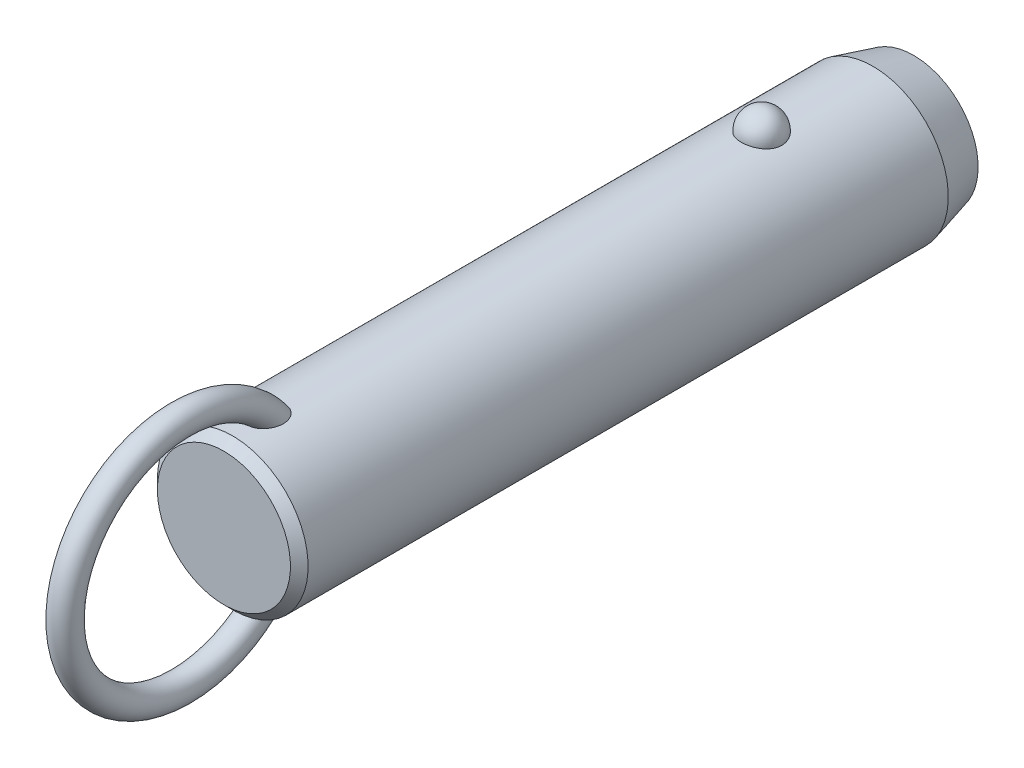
ISO-10303-21;
HEADER;
FILE_DESCRIPTION(('STEP AP214'),'2;1');
FILE_NAME('part.step','',(''),(''),'','','');
FILE_SCHEMA(('AUTOMOTIVE_DESIGN { 1 0 10303 214 1 1 1 1 }'));
ENDSEC;
DATA;
#1=APPLICATION_CONTEXT('core data for automotive mechanical design processes');
#2=APPLICATION_PROTOCOL_DEFINITION('international standard','automotive_design',2000,#1);
#3=PRODUCT_CONTEXT('',#1,'mechanical');
#4=PRODUCT('Part','Part','',(#3));
#5=PRODUCT_RELATED_PRODUCT_CATEGORY('part','',(#4));
#6=PRODUCT_DEFINITION_FORMATION('','',#4);
#7=PRODUCT_DEFINITION_CONTEXT('part definition',#1,'design');
#8=PRODUCT_DEFINITION('design','',#6,#7);
#9=PRODUCT_DEFINITION_SHAPE('','',#8);
#10=(LENGTH_UNIT() NAMED_UNIT(*) SI_UNIT(.MILLI.,.METRE.));
#11=(NAMED_UNIT(*) PLANE_ANGLE_UNIT() SI_UNIT($,.RADIAN.));
#12=(NAMED_UNIT(*) SI_UNIT($,.STERADIAN.) SOLID_ANGLE_UNIT());
#13=UNCERTAINTY_MEASURE_WITH_UNIT(LENGTH_MEASURE(1.E-05),#10,'distance_accuracy_value','');
#14=(GEOMETRIC_REPRESENTATION_CONTEXT(3) GLOBAL_UNCERTAINTY_ASSIGNED_CONTEXT((#13)) GLOBAL_UNIT_ASSIGNED_CONTEXT((#10,
#11,#12)) REPRESENTATION_CONTEXT('',''));
#15=CARTESIAN_POINT('',(0.,0.,0.));
#16=DIRECTION('',(0.,0.,1.));
#17=DIRECTION('',(1.,0.,0.));
#18=AXIS2_PLACEMENT_3D('',#15,#16,#17);
#19=CARTESIAN_POINT('',(0.,0.,63.5));
#20=DIRECTION('',(0.,0.,-1.));
#21=DIRECTION('',(-1.,0.,0.));
#22=AXIS2_PLACEMENT_3D('',#19,#20,#21);
#23=CYLINDRICAL_SURFACE('',#22,11.1);
#24=CARTESIAN_POINT('',(2.9724815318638,10.6945945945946,-3.));
#25=CARTESIAN_POINT('',(2.97247830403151,10.6945972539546,-2.83225059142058));
#26=CARTESIAN_POINT('',(2.95876598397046,10.6984356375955,-2.66445972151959));
#27=CARTESIAN_POINT('',(2.90424529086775,10.7133624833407,-2.33362381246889));
#28=CARTESIAN_POINT('',(2.8634252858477,10.7244540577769,-2.1705808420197));
#29=CARTESIAN_POINT('',(2.75573657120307,10.7526272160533,-1.85396767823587));
#30=CARTESIAN_POINT('',(2.68887937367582,10.7697061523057,-1.70039333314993));
#31=CARTESIAN_POINT('',(2.53079696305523,10.8079438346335,-1.40691598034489));
#32=CARTESIAN_POINT('',(2.43957264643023,10.8291024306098,-1.2670124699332));
#33=CARTESIAN_POINT('',(2.23458150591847,10.8732541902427,-1.00409565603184));
#34=CARTESIAN_POINT('',(2.12071295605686,10.8962553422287,-0.881162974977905));
#35=CARTESIAN_POINT('',(1.87365402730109,10.9414421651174,-0.656352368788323));
#36=CARTESIAN_POINT('',(1.74046358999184,10.9636278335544,-0.554474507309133));
#37=CARTESIAN_POINT('',(1.45872188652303,11.0046495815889,-0.374872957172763));
#38=CARTESIAN_POINT('',(1.31021276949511,11.0234944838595,-0.297085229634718));
#39=CARTESIAN_POINT('',(1.00170030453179,11.0557957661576,-0.167529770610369));
#40=CARTESIAN_POINT('',(0.841698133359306,11.0692526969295,-0.115759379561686));
#41=CARTESIAN_POINT('',(0.517607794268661,11.0890932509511,-0.0403925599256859));
#42=CARTESIAN_POINT('',(0.353633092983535,11.0955916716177,-0.0163383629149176));
#43=CARTESIAN_POINT('',(0.0238420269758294,11.1011989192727,0.0044517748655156));
#44=CARTESIAN_POINT('',(-0.141974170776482,11.1003084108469,0.00119017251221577));
#45=CARTESIAN_POINT('',(-0.468405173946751,11.0912990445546,-0.0323233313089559));
#46=CARTESIAN_POINT('',(-0.629059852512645,11.0832767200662,-0.0622147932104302));
#47=CARTESIAN_POINT('',(-0.942937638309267,11.0609962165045,-0.147645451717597));
#48=CARTESIAN_POINT('',(-1.09616062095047,11.0467379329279,-0.203185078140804));
#49=CARTESIAN_POINT('',(-1.39181061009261,11.0134071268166,-0.3387529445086));
#50=CARTESIAN_POINT('',(-1.53417383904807,10.9943086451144,-0.418913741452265));
#51=CARTESIAN_POINT('',(-1.80342160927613,10.9533667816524,-0.60144882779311));
#52=CARTESIAN_POINT('',(-1.9303046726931,10.9315231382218,-0.703825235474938));
#53=CARTESIAN_POINT('',(-2.16747598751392,10.887005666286,-0.930091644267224));
#54=CARTESIAN_POINT('',(-2.27742774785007,10.8643239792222,-1.05433291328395));
#55=CARTESIAN_POINT('',(-2.47517316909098,10.8209886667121,-1.31966633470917));
#56=CARTESIAN_POINT('',(-2.56296538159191,10.8003351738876,-1.46075958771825));
#57=CARTESIAN_POINT('',(-2.71500300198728,10.7631304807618,-1.75753646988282));
#58=CARTESIAN_POINT('',(-2.77898901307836,10.7466250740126,-1.91335887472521));
#59=CARTESIAN_POINT('',(-2.88046189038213,10.7198747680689,-2.2339152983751));
#60=CARTESIAN_POINT('',(-2.91794947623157,10.709629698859,-2.39864907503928));
#61=CARTESIAN_POINT('',(-2.96537819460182,10.6965949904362,-2.73165170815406));
#62=CARTESIAN_POINT('',(-2.97542891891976,10.693775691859,-2.89990378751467));
#63=CARTESIAN_POINT('',(-2.96804271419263,10.6958279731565,-3.235752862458));
#64=CARTESIAN_POINT('',(-2.95060646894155,10.7006993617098,-3.40334987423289));
#65=CARTESIAN_POINT('',(-2.88883358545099,10.71753912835,-3.73233906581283));
#66=CARTESIAN_POINT('',(-2.84462026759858,10.7294749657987,-3.89375610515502));
#67=CARTESIAN_POINT('',(-2.73050447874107,10.7590797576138,-4.20667949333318));
#68=CARTESIAN_POINT('',(-2.66060103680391,10.7767489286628,-4.35818546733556));
#69=CARTESIAN_POINT('',(-2.49642559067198,10.8159599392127,-4.6478542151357));
#70=CARTESIAN_POINT('',(-2.40203047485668,10.8375211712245,-4.78594458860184));
#71=CARTESIAN_POINT('',(-2.19143488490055,10.8820570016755,-5.0441038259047));
#72=CARTESIAN_POINT('',(-2.07523364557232,10.9050316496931,-5.16417205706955));
#73=CARTESIAN_POINT('',(-1.82361254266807,10.9499219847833,-5.38334833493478));
#74=CARTESIAN_POINT('',(-1.68812945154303,10.9718338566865,-5.48238464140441));
#75=CARTESIAN_POINT('',(-1.40191298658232,11.0120611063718,-5.65618873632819));
#76=CARTESIAN_POINT('',(-1.25118062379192,11.0303767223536,-5.73095813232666));
#77=CARTESIAN_POINT('',(-0.940570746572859,11.0611653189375,-5.85334725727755));
#78=CARTESIAN_POINT('',(-0.780821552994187,11.0737044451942,-5.90127578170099));
#79=CARTESIAN_POINT('',(-0.455204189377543,11.0918598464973,-5.96992976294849));
#80=CARTESIAN_POINT('',(-0.289336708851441,11.0974768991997,-5.99065827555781));
#81=CARTESIAN_POINT('',(0.0406846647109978,11.1011307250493,-6.00418773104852));
#82=CARTESIAN_POINT('',(0.204817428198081,11.099299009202,-5.99747318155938));
#83=CARTESIAN_POINT('',(0.5295530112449,11.088551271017,-5.9574031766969));
#84=CARTESIAN_POINT('',(0.69015594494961,11.0796354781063,-5.92404858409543));
#85=CARTESIAN_POINT('',(1.0027760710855,11.0557204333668,-5.83180084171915));
#86=CARTESIAN_POINT('',(1.15482001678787,11.0407414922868,-5.77299291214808));
#87=CARTESIAN_POINT('',(1.44678373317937,11.0062913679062,-5.63147366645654));
#88=CARTESIAN_POINT('',(1.58670279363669,10.9868199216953,-5.54876095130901));
#89=CARTESIAN_POINT('',(1.8527023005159,10.9451315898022,-5.36027644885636));
#90=CARTESIAN_POINT('',(1.97855158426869,10.9228788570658,-5.25418644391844));
#91=CARTESIAN_POINT('',(2.21080872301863,10.8782509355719,-5.02251354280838));
#92=CARTESIAN_POINT('',(2.31721312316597,10.8558757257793,-4.89692718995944));
#93=CARTESIAN_POINT('',(2.5094551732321,10.8130715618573,-4.62745408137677));
#94=CARTESIAN_POINT('',(2.59493284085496,10.7926798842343,-4.48330448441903));
#95=CARTESIAN_POINT('',(2.740862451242,10.7565495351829,-4.18236358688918));
#96=CARTESIAN_POINT('',(2.80132490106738,10.7408089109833,-4.02557762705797));
#97=CARTESIAN_POINT('',(2.88959070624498,10.7173718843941,-3.72475308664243));
#98=CARTESIAN_POINT('',(2.92062102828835,10.7088950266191,-3.58171216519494));
#99=CARTESIAN_POINT('',(2.96206765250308,10.6975052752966,-3.29245795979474));
#100=CARTESIAN_POINT('',(2.97248434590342,10.6945922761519,-3.14624473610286));
#101=CARTESIAN_POINT('',(2.9724815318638,10.6945945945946,-3.));
#102=B_SPLINE_CURVE_WITH_KNOTS('',3,(#24,#25,#26,#27,#28,#29,#30,#31,#32,#33,#34,#35,#36,#37,
#38,#39,#40,#41,#42,#43,#44,#45,#46,#47,#48,#49,#50,#51,#52,#53,#54,#55,#56,#57,#58,#59,#60,#61,
#62,#63,#64,#65,#66,#67,#68,#69,#70,#71,#72,#73,#74,#75,#76,#77,#78,#79,#80,#81,#82,#83,#84,#85,
#86,#87,#88,#89,#90,#91,#92,#93,#94,#95,#96,#97,#98,#99,#100,#101),.UNSPECIFIED.,.T.,.F.,(4,2,2,
2,2,2,2,2,2,2,2,2,2,2,2,2,2,2,2,2,2,2,2,2,2,2,2,2,2,2,2,2,2,2,2,2,2,2,4),(0.,0.502722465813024,
1.00566079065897,1.5083769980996,2.01107471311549,2.51608392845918,3.02109467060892,
3.52475118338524,4.02835620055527,4.523518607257,5.0186364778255,5.50715297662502,
5.9956776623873,6.48688002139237,6.97812923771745,7.47814366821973,7.9781907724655,
8.48353712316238,8.9888697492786,9.49218093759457,9.99547960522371,10.4964777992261,
10.997494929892,11.5010810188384,12.0046847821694,12.5099796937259,13.0152411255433,
13.5145635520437,14.0138298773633,14.5043200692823,14.9947943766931,15.4836390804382,
15.9725123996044,16.4685040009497,16.9645836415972,17.4686765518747,17.972557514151,
18.410841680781,18.849117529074),.UNSPECIFIED.);
#103=CARTESIAN_POINT('',(2.9724815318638,10.6945945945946,-3.));
#104=VERTEX_POINT('',#103);
#105=EDGE_CURVE('E41',#104,#104,#102,.T.);
#106=ORIENTED_EDGE('',*,*,#105,.T.);
#107=EDGE_LOOP('',(#106));
#108=FACE_BOUND('',#107,.T.);
#109=CARTESIAN_POINT('',(0.,0.,74.9));
#110=DIRECTION('',(0.,0.,1.));
#111=DIRECTION('',(1.,0.,0.));
#112=AXIS2_PLACEMENT_3D('',#109,#110,#111);
#113=CIRCLE('',#112,11.1);
#114=CARTESIAN_POINT('',(-11.1,0.,74.9));
#115=VERTEX_POINT('',#114);
#116=EDGE_CURVE('E10',#115,#115,#113,.F.);
#117=ORIENTED_EDGE('',*,*,#116,.T.);
#118=EDGE_LOOP('',(#117));
#119=FACE_BOUND('',#118,.T.);
#120=CARTESIAN_POINT('',(-0.564520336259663,-11.0856356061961,67.1578154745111));
#121=CARTESIAN_POINT('',(-0.667202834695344,-11.0804062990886,67.1912839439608));
#122=CARTESIAN_POINT('',(-0.766875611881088,-11.0738877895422,67.2338357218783));
#123=CARTESIAN_POINT('',(-0.957284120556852,-11.0590576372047,67.3354190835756));
#124=CARTESIAN_POINT('',(-1.04801616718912,-11.0507452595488,67.3944574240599));
#125=CARTESIAN_POINT('',(-1.21800952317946,-11.0333016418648,67.5265293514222));
#126=CARTESIAN_POINT('',(-1.29730805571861,-11.0241732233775,67.5995156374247));
#127=CARTESIAN_POINT('',(-1.44337665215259,-11.0060026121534,67.7570374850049));
#128=CARTESIAN_POINT('',(-1.51014622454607,-10.9969604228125,67.8415734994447));
#129=CARTESIAN_POINT('',(-1.63454620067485,-10.9791841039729,68.0255213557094));
#130=CARTESIAN_POINT('',(-1.69127003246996,-10.9705107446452,68.1255493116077));
#131=CARTESIAN_POINT('',(-1.78980785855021,-10.9548648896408,68.3327902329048));
#132=CARTESIAN_POINT('',(-1.83161214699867,-10.9478935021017,68.4400078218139));
#133=CARTESIAN_POINT('',(-1.91557028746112,-10.9335803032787,68.7054080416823));
#134=CARTESIAN_POINT('',(-1.95040620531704,-10.9273269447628,68.8659806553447));
#135=CARTESIAN_POINT('',(-1.99388326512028,-10.9194709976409,69.1906977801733));
#136=CARTESIAN_POINT('',(-2.00248051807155,-10.9178762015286,69.3548478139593));
#137=CARTESIAN_POINT('',(-1.99551615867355,-10.9191578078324,69.7246504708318));
#138=CARTESIAN_POINT('',(-1.9732206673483,-10.9232807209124,69.9301911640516));
#139=CARTESIAN_POINT('',(-1.91529761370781,-10.9335244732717,70.233595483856));
#140=CARTESIAN_POINT('',(-1.8918457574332,-10.9376266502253,70.3340883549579));
#141=CARTESIAN_POINT('',(-1.83700674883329,-10.9469720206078,70.532855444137));
#142=CARTESIAN_POINT('',(-1.80562070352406,-10.9522150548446,70.6311299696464));
#143=CARTESIAN_POINT('',(-1.73463055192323,-10.9636837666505,70.8259148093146));
#144=CARTESIAN_POINT('',(-1.69493416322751,-10.9699202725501,70.9223907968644));
#145=CARTESIAN_POINT('',(-1.60745141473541,-10.9830806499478,71.1116262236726));
#146=CARTESIAN_POINT('',(-1.55966150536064,-10.9900048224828,71.2043840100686));
#147=CARTESIAN_POINT('',(-1.45591812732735,-11.0042280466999,71.3846907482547));
#148=CARTESIAN_POINT('',(-1.40000013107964,-11.0115253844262,71.4722601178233));
#149=CARTESIAN_POINT('',(-1.27937470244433,-11.0261911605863,71.6410298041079));
#150=CARTESIAN_POINT('',(-1.21467835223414,-11.0335594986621,71.7222379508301));
#151=CARTESIAN_POINT('',(-1.08218150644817,-11.0473027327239,71.8690010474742));
#152=CARTESIAN_POINT('',(-1.01522633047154,-11.0537063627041,71.935309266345));
#153=CARTESIAN_POINT('',(-0.872952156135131,-11.065850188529,72.0583780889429));
#154=CARTESIAN_POINT('',(-0.797642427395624,-11.0715911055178,72.1151491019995));
#155=CARTESIAN_POINT('',(-0.651396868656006,-11.081071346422,72.2075155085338));
#156=CARTESIAN_POINT('',(-0.581712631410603,-11.0849841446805,72.2450491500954));
#157=CARTESIAN_POINT('',(-0.437066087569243,-11.0916271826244,72.3082594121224));
#158=CARTESIAN_POINT('',(-0.362109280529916,-11.0943586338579,72.3339481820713));
#159=CARTESIAN_POINT('',(-0.207828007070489,-11.0983242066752,72.371117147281));
#160=CARTESIAN_POINT('',(-0.128467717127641,-11.0995432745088,72.3824545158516));
#161=CARTESIAN_POINT('',(0.0309101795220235,-11.1002423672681,72.3889658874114));
#162=CARTESIAN_POINT('',(0.110927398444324,-11.0997233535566,72.3841488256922));
#163=CARTESIAN_POINT('',(0.256406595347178,-11.097240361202,72.3609599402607));
#164=CARTESIAN_POINT('',(0.32223577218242,-11.0955074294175,72.3447543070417));
#165=CARTESIAN_POINT('',(0.450635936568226,-11.0910350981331,72.3026008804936));
#166=CARTESIAN_POINT('',(0.513205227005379,-11.0882951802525,72.2766480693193));
#167=CARTESIAN_POINT('',(0.662626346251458,-11.0805620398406,72.2026073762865));
#168=CARTESIAN_POINT('',(0.747127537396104,-11.0751144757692,72.1498452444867));
#169=CARTESIAN_POINT('',(0.906756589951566,-11.0631932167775,72.0317206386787));
#170=CARTESIAN_POINT('',(0.981859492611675,-11.0567168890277,71.9663257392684));
#171=CARTESIAN_POINT('',(1.10712207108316,-11.0447856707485,71.8422633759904));
#172=CARTESIAN_POINT('',(1.15909566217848,-11.0394280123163,71.7853831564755));
#173=CARTESIAN_POINT('',(1.25791923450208,-11.0286040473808,71.6673271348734));
#174=CARTESIAN_POINT('',(1.30476642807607,-11.0231376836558,71.6061490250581));
#175=CARTESIAN_POINT('',(1.43818612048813,-11.0068027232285,71.4173051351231));
#176=CARTESIAN_POINT('',(1.51751767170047,-10.9960104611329,71.2844531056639));
#177=CARTESIAN_POINT('',(1.63597546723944,-10.9788847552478,71.0531371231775));
#178=CARTESIAN_POINT('',(1.67988876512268,-10.9722190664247,70.9570530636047));
#179=CARTESIAN_POINT('',(1.75953241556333,-10.9597298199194,70.7614311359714));
#180=CARTESIAN_POINT('',(1.79525967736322,-10.9539065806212,70.6618919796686));
#181=CARTESIAN_POINT('',(1.85844731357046,-10.9433632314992,70.4602111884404));
#182=CARTESIAN_POINT('',(1.88591073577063,-10.9386427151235,70.3580705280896));
#183=CARTESIAN_POINT('',(1.93234324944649,-10.9305350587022,70.1518191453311));
#184=CARTESIAN_POINT('',(1.95131065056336,-10.9271481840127,70.0477080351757));
#185=CARTESIAN_POINT('',(1.99040203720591,-10.9201183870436,69.7654588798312));
#186=CARTESIAN_POINT('',(2.00221217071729,-10.9179256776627,69.5860370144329));
#187=CARTESIAN_POINT('',(1.99711676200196,-10.9188636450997,69.2277133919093));
#188=CARTESIAN_POINT('',(1.98026150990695,-10.9219849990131,69.048811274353));
#189=CARTESIAN_POINT('',(1.92151657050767,-10.9324473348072,68.7364514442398));
#190=CARTESIAN_POINT('',(1.88605081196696,-10.9386915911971,68.6017594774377));
#191=CARTESIAN_POINT('',(1.7939302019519,-10.9541780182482,68.3399669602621));
#192=CARTESIAN_POINT('',(1.73729868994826,-10.9634168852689,68.2128582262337));
#193=CARTESIAN_POINT('',(1.612370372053,-10.9824218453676,67.9894184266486));
#194=CARTESIAN_POINT('',(1.54715374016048,-10.9918945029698,67.8913455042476));
#195=CARTESIAN_POINT('',(1.40127026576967,-11.0114415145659,67.7074341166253));
#196=CARTESIAN_POINT('',(1.32060742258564,-11.0215157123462,67.6215924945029));
#197=CARTESIAN_POINT('',(1.14474787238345,-11.041168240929,67.4651630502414));
#198=CARTESIAN_POINT('',(1.04947805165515,-11.0507437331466,67.3946565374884));
#199=CARTESIAN_POINT('',(0.847278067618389,-11.0680789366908,67.272640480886));
#200=CARTESIAN_POINT('',(0.740351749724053,-11.0758392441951,67.2211246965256));
#201=CARTESIAN_POINT('',(0.529289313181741,-11.0878275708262,67.1434852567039));
#202=CARTESIAN_POINT('',(0.425895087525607,-11.0923259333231,67.115377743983));
#203=CARTESIAN_POINT('',(0.215723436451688,-11.0984001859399,67.0777038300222));
#204=CARTESIAN_POINT('',(0.108947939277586,-11.0999777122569,67.0681270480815));
#205=CARTESIAN_POINT('',(-0.0938962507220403,-11.1000196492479,67.0678773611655));
#206=CARTESIAN_POINT('',(-0.189967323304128,-11.0987797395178,67.0754089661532));
#207=CARTESIAN_POINT('',(-0.379657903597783,-11.0939111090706,67.1055079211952));
#208=CARTESIAN_POINT('',(-0.473277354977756,-11.0902823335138,67.1280756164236));
#209=CARTESIAN_POINT('',(-0.564520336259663,-11.0856356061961,67.1578154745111));
#210=B_SPLINE_CURVE_WITH_KNOTS('',3,(#120,#121,#122,#123,#124,#125,#126,#127,#128,#129,#130,
#131,#132,#133,#134,#135,#136,#137,#138,#139,#140,#141,#142,#143,#144,#145,#146,#147,#148,#149,
#150,#151,#152,#153,#154,#155,#156,#157,#158,#159,#160,#161,#162,#163,#164,#165,#166,#167,#168,
#169,#170,#171,#172,#173,#174,#175,#176,#177,#178,#179,#180,#181,#182,#183,#184,#185,#186,#187,
#188,#189,#190,#191,#192,#193,#194,#195,#196,#197,#198,#199,#200,#201,#202,#203,#204,#205,#206,
#207,#208,#209),.UNSPECIFIED.,.T.,.F.,(4,2,2,2,2,2,2,2,2,2,2,2,2,2,2,2,2,2,2,2,2,2,2,2,2,2,2,2,
2,2,2,2,2,2,2,2,2,2,2,2,2,2,2,2,4),(0.,0.323999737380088,0.648132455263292,0.971184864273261,
1.29424994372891,1.6388623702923,1.98369857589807,2.47426059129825,2.96564271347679,
3.58257396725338,3.89215258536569,4.20168803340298,4.51486273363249,4.82817514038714,
5.14015911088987,5.45175282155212,5.73442856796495,6.01679375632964,6.25364580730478,
6.49025437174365,6.7291996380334,6.96801276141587,7.17061258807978,7.37331685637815,
7.67094989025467,7.96935728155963,8.20075067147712,8.43226927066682,8.89581623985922,
9.21306533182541,9.53043400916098,9.84768549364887,10.1650000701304,10.70229304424,
11.2386443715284,11.6553390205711,12.0715755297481,12.4245637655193,12.7774607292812,
13.1321855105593,13.4867936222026,13.8068771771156,14.1267813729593,14.4146787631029,
14.7025827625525),.UNSPECIFIED.);
#211=CARTESIAN_POINT('',(-0.564520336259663,-11.0856356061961,67.1578154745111));
#212=VERTEX_POINT('',#211);
#213=EDGE_CURVE('E60',#212,#212,#210,.T.);
#214=ORIENTED_EDGE('',*,*,#213,.T.);
#215=EDGE_LOOP('',(#214));
#216=FACE_BOUND('',#215,.T.);
#217=CARTESIAN_POINT('',(-0.564520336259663,11.0856356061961,67.1578154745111));
#218=CARTESIAN_POINT('',(-0.468542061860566,11.0905203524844,67.1265456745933));
#219=CARTESIAN_POINT('',(-0.36979381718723,11.0942886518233,67.1031576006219));
#220=CARTESIAN_POINT('',(-0.169555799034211,11.0991586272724,67.0730858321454));
#221=CARTESIAN_POINT('',(-0.0680604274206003,11.1002543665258,67.0664393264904));
#222=CARTESIAN_POINT('',(0.134549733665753,11.099646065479,67.0701579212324));
#223=CARTESIAN_POINT('',(0.235664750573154,11.0979441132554,67.0805103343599));
#224=CARTESIAN_POINT('',(0.434632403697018,11.0919342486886,67.1178318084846));
#225=CARTESIAN_POINT('',(0.53248665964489,11.0876276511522,67.1447924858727));
#226=CARTESIAN_POINT('',(0.722445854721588,11.0768742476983,67.2144096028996));
#227=CARTESIAN_POINT('',(0.814543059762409,11.0704246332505,67.2570866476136));
#228=CARTESIAN_POINT('',(0.99056508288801,11.0560659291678,67.3566487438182));
#229=CARTESIAN_POINT('',(1.07448844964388,11.048156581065,67.4135363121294));
#230=CARTESIAN_POINT('',(1.23562672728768,11.0313221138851,67.5422106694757));
#231=CARTESIAN_POINT('',(1.31242684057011,11.0223686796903,67.6145117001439));
#232=CARTESIAN_POINT('',(1.45398030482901,11.0045918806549,67.7700425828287));
#233=CARTESIAN_POINT('',(1.51873073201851,10.9957685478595,67.8532750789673));
#234=CARTESIAN_POINT('',(1.64107232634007,10.9782087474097,68.0363842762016));
#235=CARTESIAN_POINT('',(1.69743176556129,10.9695572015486,68.1370893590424));
#236=CARTESIAN_POINT('',(1.79515063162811,10.9539887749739,68.3456264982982));
#237=CARTESIAN_POINT('',(1.83649966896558,10.9470730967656,68.4534634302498));
#238=CARTESIAN_POINT('',(1.91931148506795,10.9329211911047,68.7203995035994));
#239=CARTESIAN_POINT('',(1.9534010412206,10.9267904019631,68.8818612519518));
#240=CARTESIAN_POINT('',(1.99526195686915,10.9192174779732,69.2082163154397));
#241=CARTESIAN_POINT('',(2.00298989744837,10.9177830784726,69.3731148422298));
#242=CARTESIAN_POINT('',(1.99396251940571,10.9194420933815,69.7441006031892));
#243=CARTESIAN_POINT('',(1.97050829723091,10.923774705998,69.9500387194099));
#244=CARTESIAN_POINT('',(1.91079643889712,10.9343131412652,70.2539019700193));
#245=CARTESIAN_POINT('',(1.88673702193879,10.9385106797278,70.3545296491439));
#246=CARTESIAN_POINT('',(1.83065508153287,10.9480376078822,70.5535107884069));
#247=CARTESIAN_POINT('',(1.79863369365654,10.9533668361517,70.651864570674));
#248=CARTESIAN_POINT('',(1.72633365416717,10.9649954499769,70.846720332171));
#249=CARTESIAN_POINT('',(1.68596409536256,10.9713053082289,70.9431879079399));
#250=CARTESIAN_POINT('',(1.59707998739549,10.9845964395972,71.1323233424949));
#251=CARTESIAN_POINT('',(1.54856169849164,10.9915780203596,71.2249894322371));
#252=CARTESIAN_POINT('',(1.44330168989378,11.0058935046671,71.4049752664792));
#253=CARTESIAN_POINT('',(1.38659749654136,11.0132257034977,71.492316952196));
#254=CARTESIAN_POINT('',(1.26431158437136,11.0279330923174,71.6604563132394));
#255=CARTESIAN_POINT('',(1.19874160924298,11.0353082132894,71.7412624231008));
#256=CARTESIAN_POINT('',(1.06542088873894,11.0489310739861,71.8859856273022));
#257=CARTESIAN_POINT('',(0.998640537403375,11.0552153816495,71.950784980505));
#258=CARTESIAN_POINT('',(0.856896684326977,11.0671032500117,72.0708462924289));
#259=CARTESIAN_POINT('',(0.781942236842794,11.0727075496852,72.1261186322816));
#260=CARTESIAN_POINT('',(0.636276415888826,11.081949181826,72.2159721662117));
#261=CARTESIAN_POINT('',(0.566755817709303,11.0857572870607,72.2524410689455));
#262=CARTESIAN_POINT('',(0.422602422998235,11.0921860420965,72.3135333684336));
#263=CARTESIAN_POINT('',(0.347974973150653,11.0948079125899,72.3381689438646));
#264=CARTESIAN_POINT('',(0.194593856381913,11.0985608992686,72.3733233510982));
#265=CARTESIAN_POINT('',(0.115807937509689,11.0996777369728,72.3837069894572));
#266=CARTESIAN_POINT('',(-0.0422499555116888,11.1002003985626,72.3885747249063));
#267=CARTESIAN_POINT('',(-0.121521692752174,11.09960699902,72.383066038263));
#268=CARTESIAN_POINT('',(-0.266046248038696,11.0970123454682,72.3588271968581));
#269=CARTESIAN_POINT('',(-0.331661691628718,11.0952283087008,72.3421356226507));
#270=CARTESIAN_POINT('',(-0.459588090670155,11.0906663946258,72.2991117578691));
#271=CARTESIAN_POINT('',(-0.521897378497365,11.0878880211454,72.272774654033));
#272=CARTESIAN_POINT('',(-0.671446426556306,11.0800342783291,72.1975130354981));
#273=CARTESIAN_POINT('',(-0.756250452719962,11.0744969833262,72.1438182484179));
#274=CARTESIAN_POINT('',(-0.916349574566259,11.0624045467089,72.0238029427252));
#275=CARTESIAN_POINT('',(-0.99161892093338,11.0558467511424,71.9574493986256));
#276=CARTESIAN_POINT('',(-1.11713140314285,11.0437783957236,71.8316335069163));
#277=CARTESIAN_POINT('',(-1.16920539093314,11.0383619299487,71.7739524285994));
#278=CARTESIAN_POINT('',(-1.26817476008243,11.02743010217,71.6542809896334));
#279=CARTESIAN_POINT('',(-1.31506731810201,11.0219146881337,71.5922883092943));
#280=CARTESIAN_POINT('',(-1.40399813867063,11.0109399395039,71.4647843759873));
#281=CARTESIAN_POINT('',(-1.4460286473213,11.0054807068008,71.3992677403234));
#282=CARTESIAN_POINT('',(-1.52538779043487,10.9947621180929,71.2654223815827));
#283=CARTESIAN_POINT('',(-1.56271516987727,10.9895028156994,71.1970929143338));
#284=CARTESIAN_POINT('',(-1.64537943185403,10.9774790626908,71.0332101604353));
#285=CARTESIAN_POINT('',(-1.68879497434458,10.9708503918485,70.9366735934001));
#286=CARTESIAN_POINT('',(-1.76740738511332,10.9584602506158,70.7402369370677));
#287=CARTESIAN_POINT('',(-1.80260120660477,10.95269910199,70.6403356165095));
#288=CARTESIAN_POINT('',(-1.86468657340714,10.9423003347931,70.4379663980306));
#289=CARTESIAN_POINT('',(-1.8915816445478,10.9376622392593,70.3354996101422));
#290=CARTESIAN_POINT('',(-1.93682458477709,10.9297405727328,70.1286429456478));
#291=CARTESIAN_POINT('',(-1.9551708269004,10.9264572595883,70.0242527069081));
#292=CARTESIAN_POINT('',(-1.99232562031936,10.9197647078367,69.7426287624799));
#293=CARTESIAN_POINT('',(-2.00294603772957,10.9177914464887,69.5641857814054));
#294=CARTESIAN_POINT('',(-1.99566675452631,10.9191290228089,69.2079962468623));
#295=CARTESIAN_POINT('',(-1.97781651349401,10.9224306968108,69.0302490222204));
#296=CARTESIAN_POINT('',(-1.91747214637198,10.9331592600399,68.7197921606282));
#297=CARTESIAN_POINT('',(-1.88131022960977,10.9395108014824,68.585825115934));
#298=CARTESIAN_POINT('',(-1.7879038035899,10.9551659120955,68.3255975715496));
#299=CARTESIAN_POINT('',(-1.7306830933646,10.9644661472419,68.1993285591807));
#300=CARTESIAN_POINT('',(-1.60475573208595,10.9835398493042,67.9774156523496));
#301=CARTESIAN_POINT('',(-1.53908879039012,10.9930297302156,67.8800265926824));
#302=CARTESIAN_POINT('',(-1.39238608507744,11.0125708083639,67.6975250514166));
#303=CARTESIAN_POINT('',(-1.31135150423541,11.0226219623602,67.6124116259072));
#304=CARTESIAN_POINT('',(-1.14382035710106,11.0411991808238,67.4652994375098));
#305=CARTESIAN_POINT('',(-1.05858500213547,11.0497792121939,67.4018693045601));
#306=CARTESIAN_POINT('',(-0.878723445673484,11.0655285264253,67.2902505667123));
#307=CARTESIAN_POINT('',(-0.784123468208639,11.0727015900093,67.2420208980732));
#308=CARTESIAN_POINT('',(-0.646163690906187,11.0812501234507,67.186023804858));
#309=CARTESIAN_POINT('',(-0.605595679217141,11.0835451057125,67.1711978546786));
#310=CARTESIAN_POINT('',(-0.564520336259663,11.0856356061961,67.1578154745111));
#311=B_SPLINE_CURVE_WITH_KNOTS('',3,(#217,#218,#219,#220,#221,#222,#223,#224,#225,#226,#227,
#228,#229,#230,#231,#232,#233,#234,#235,#236,#237,#238,#239,#240,#241,#242,#243,#244,#245,#246,
#247,#248,#249,#250,#251,#252,#253,#254,#255,#256,#257,#258,#259,#260,#261,#262,#263,#264,#265,
#266,#267,#268,#269,#270,#271,#272,#273,#274,#275,#276,#277,#278,#279,#280,#281,#282,#283,#284,
#285,#286,#287,#288,#289,#290,#291,#292,#293,#294,#295,#296,#297,#298,#299,#300,#301,#302,#303,
#304,#305,#306,#307,#308,#309,#310),.UNSPECIFIED.,.T.,.F.,(4,2,2,2,2,2,2,2,2,2,2,2,2,2,2,2,2,2,
2,2,2,2,2,2,2,2,2,2,2,2,2,2,2,2,2,2,2,2,2,2,2,2,2,2,2,2,4),(0.,0.303061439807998,
0.606795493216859,0.910302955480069,1.21365733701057,1.51741085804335,1.82121821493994,
2.13745205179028,2.45376252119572,2.79958678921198,3.14564996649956,3.63832391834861,
4.13180893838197,4.75031912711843,5.06071926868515,5.37107516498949,5.68500772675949,
5.99908475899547,6.31176519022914,6.62403542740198,6.90315673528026,7.1819719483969,
7.41687778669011,7.65154134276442,7.88841587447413,8.12518286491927,8.3275284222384,
8.52997509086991,8.82986421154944,9.13054668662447,9.36393502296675,9.59744991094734,
9.83133221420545,10.0652767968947,10.383032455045,10.7009056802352,11.0186436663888,
11.3364420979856,11.8705925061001,12.4038159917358,12.8189662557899,13.2336487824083,
13.5857049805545,13.9377340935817,14.2561354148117,14.5736690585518,14.7033687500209),.UNSPECIFIED.);
#312=CARTESIAN_POINT('',(-0.564520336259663,11.0856356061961,67.1578154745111));
#313=VERTEX_POINT('',#312);
#314=EDGE_CURVE('E68',#313,#313,#311,.T.);
#315=ORIENTED_EDGE('',*,*,#314,.T.);
#316=EDGE_LOOP('',(#315));
#317=FACE_BOUND('',#316,.T.);
#318=CARTESIAN_POINT('',(0.,0.,-19.3999999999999));
#319=DIRECTION('',(0.,0.,-1.));
#320=DIRECTION('',(-1.,0.,0.));
#321=AXIS2_PLACEMENT_3D('',#318,#319,#320);
#322=CIRCLE('',#321,11.1);
#323=CARTESIAN_POINT('',(-11.1,0.,-19.3999999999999));
#324=VERTEX_POINT('',#323);
#325=EDGE_CURVE('E57',#324,#324,#322,.F.);
#326=ORIENTED_EDGE('',*,*,#325,.T.);
#327=EDGE_LOOP('',(#326));
#328=FACE_BOUND('',#327,.T.);
#329=ADVANCED_FACE('F37',(#108,#119,#216,#317,#328),#23,.T.);
#330=CARTESIAN_POINT('',(0.,0.,-25.4));
#331=DIRECTION('',(0.,0.,-1.));
#332=DIRECTION('',(-1.,0.,0.));
#333=AXIS2_PLACEMENT_3D('',#330,#331,#332);
#334=PLANE('',#333);
#335=CARTESIAN_POINT('',(0.,0.,-25.4));
#336=DIRECTION('',(0.,0.,-1.));
#337=DIRECTION('',(-1.,0.,0.));
#338=AXIS2_PLACEMENT_3D('',#335,#336,#337);
#339=CIRCLE('',#338,9.49230484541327);
#340=CARTESIAN_POINT('',(-9.49230484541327,0.,-25.4));
#341=VERTEX_POINT('',#340);
#342=EDGE_CURVE('E67',#341,#341,#339,.T.);
#343=ORIENTED_EDGE('',*,*,#342,.T.);
#344=EDGE_LOOP('',(#343));
#345=FACE_BOUND('',#344,.T.);
#346=ADVANCED_FACE('F86',(#345),#334,.T.);
#347=CARTESIAN_POINT('',(0.,0.,-25.4));
#348=DIRECTION('',(0.,0.,1.));
#349=DIRECTION('',(1.,0.,0.));
#350=AXIS2_PLACEMENT_3D('',#347,#348,#349);
#351=CONICAL_SURFACE('',#350,9.49230484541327,0.261799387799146);
#352=ORIENTED_EDGE('',*,*,#325,.F.);
#353=EDGE_LOOP('',(#352));
#354=FACE_BOUND('',#353,.T.);
#355=ORIENTED_EDGE('',*,*,#342,.F.);
#356=EDGE_LOOP('',(#355));
#357=FACE_BOUND('',#356,.T.);
#358=ADVANCED_FACE('F84',(#354,#357),#351,.T.);
#359=CARTESIAN_POINT('',(0.,0.,76.2));
#360=DIRECTION('',(0.,0.,1.));
#361=DIRECTION('',(1.,0.,0.));
#362=AXIS2_PLACEMENT_3D('',#359,#360,#361);
#363=PLANE('',#362);
#364=CARTESIAN_POINT('',(0.,0.,76.2));
#365=DIRECTION('',(0.,0.,1.));
#366=DIRECTION('',(1.,0.,0.));
#367=AXIS2_PLACEMENT_3D('',#364,#365,#366);
#368=CIRCLE('',#367,9.8);
#369=CARTESIAN_POINT('',(-9.80000000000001,0.,76.2));
#370=VERTEX_POINT('',#369);
#371=EDGE_CURVE('E50',#370,#370,#368,.T.);
#372=ORIENTED_EDGE('',*,*,#371,.T.);
#373=EDGE_LOOP('',(#372));
#374=FACE_BOUND('',#373,.T.);
#375=ADVANCED_FACE('F78',(#374),#363,.T.);
#376=CARTESIAN_POINT('',(0.,0.,82.55));
#377=DIRECTION('',(1.,0.,0.));
#378=DIRECTION('',(0.,0.,-1.));
#379=AXIS2_PLACEMENT_3D('',#376,#377,#378);
#380=TOROIDAL_SURFACE('',#379,17.05,2.);
#381=ORIENTED_EDGE('',*,*,#314,.F.);
#382=EDGE_LOOP('',(#381));
#383=FACE_BOUND('',#382,.T.);
#384=ORIENTED_EDGE('',*,*,#213,.F.);
#385=EDGE_LOOP('',(#384));
#386=FACE_BOUND('',#385,.T.);
#387=ADVANCED_FACE('F74',(#383,#386),#380,.T.);
#388=CARTESIAN_POINT('',(0.,0.,76.2));
#389=DIRECTION('',(0.,0.,-1.));
#390=DIRECTION('',(-1.,0.,0.));
#391=AXIS2_PLACEMENT_3D('',#388,#389,#390);
#392=CONICAL_SURFACE('',#391,9.8,0.785398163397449);
#393=CARTESIAN_POINT('',(-11.1,0.,74.9));
#394=CARTESIAN_POINT('',(-11.0864583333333,0.,74.9135416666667));
#395=CARTESIAN_POINT('',(-11.0729166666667,0.,74.9270833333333));
#396=CARTESIAN_POINT('',(-11.0458333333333,0.,74.9541666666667));
#397=CARTESIAN_POINT('',(-11.0322916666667,0.,74.9677083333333));
#398=CARTESIAN_POINT('',(-11.0052083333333,0.,74.9947916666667));
#399=CARTESIAN_POINT('',(-10.9916666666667,0.,75.0083333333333));
#400=CARTESIAN_POINT('',(-10.9645833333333,0.,75.0354166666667));
#401=CARTESIAN_POINT('',(-10.9510416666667,0.,75.0489583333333));
#402=CARTESIAN_POINT('',(-10.9239583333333,0.,75.0760416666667));
#403=CARTESIAN_POINT('',(-10.9104166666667,0.,75.0895833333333));
#404=CARTESIAN_POINT('',(-10.8833333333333,0.,75.1166666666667));
#405=CARTESIAN_POINT('',(-10.8697916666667,0.,75.1302083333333));
#406=CARTESIAN_POINT('',(-10.8427083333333,0.,75.1572916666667));
#407=CARTESIAN_POINT('',(-10.8291666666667,0.,75.1708333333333));
#408=CARTESIAN_POINT('',(-10.8020833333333,0.,75.1979166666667));
#409=CARTESIAN_POINT('',(-10.7885416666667,0.,75.2114583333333));
#410=CARTESIAN_POINT('',(-10.7614583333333,0.,75.2385416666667));
#411=CARTESIAN_POINT('',(-10.7479166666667,0.,75.2520833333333));
#412=CARTESIAN_POINT('',(-10.7208333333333,0.,75.2791666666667));
#413=CARTESIAN_POINT('',(-10.7072916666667,0.,75.2927083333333));
#414=CARTESIAN_POINT('',(-10.6802083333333,0.,75.3197916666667));
#415=CARTESIAN_POINT('',(-10.6666666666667,0.,75.3333333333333));
#416=CARTESIAN_POINT('',(-10.6395833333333,0.,75.3604166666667));
#417=CARTESIAN_POINT('',(-10.6260416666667,0.,75.3739583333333));
#418=CARTESIAN_POINT('',(-10.5989583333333,0.,75.4010416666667));
#419=CARTESIAN_POINT('',(-10.5854166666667,0.,75.4145833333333));
#420=CARTESIAN_POINT('',(-10.5583333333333,0.,75.4416666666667));
#421=CARTESIAN_POINT('',(-10.5447916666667,0.,75.4552083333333));
#422=CARTESIAN_POINT('',(-10.5177083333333,0.,75.4822916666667));
#423=CARTESIAN_POINT('',(-10.5041666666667,0.,75.4958333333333));
#424=CARTESIAN_POINT('',(-10.4770833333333,0.,75.5229166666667));
#425=CARTESIAN_POINT('',(-10.4635416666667,0.,75.5364583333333));
#426=CARTESIAN_POINT('',(-10.4364583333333,0.,75.5635416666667));
#427=CARTESIAN_POINT('',(-10.4229166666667,0.,75.5770833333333));
#428=CARTESIAN_POINT('',(-10.3958333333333,0.,75.6041666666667));
#429=CARTESIAN_POINT('',(-10.3822916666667,0.,75.6177083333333));
#430=CARTESIAN_POINT('',(-10.3552083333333,0.,75.6447916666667));
#431=CARTESIAN_POINT('',(-10.3416666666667,0.,75.6583333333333));
#432=CARTESIAN_POINT('',(-10.3145833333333,0.,75.6854166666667));
#433=CARTESIAN_POINT('',(-10.3010416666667,0.,75.6989583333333));
#434=CARTESIAN_POINT('',(-10.2739583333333,0.,75.7260416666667));
#435=CARTESIAN_POINT('',(-10.2604166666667,0.,75.7395833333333));
#436=CARTESIAN_POINT('',(-10.2333333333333,0.,75.7666666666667));
#437=CARTESIAN_POINT('',(-10.2197916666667,0.,75.7802083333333));
#438=CARTESIAN_POINT('',(-10.1927083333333,0.,75.8072916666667));
#439=CARTESIAN_POINT('',(-10.1791666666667,0.,75.8208333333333));
#440=CARTESIAN_POINT('',(-10.1520833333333,0.,75.8479166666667));
#441=CARTESIAN_POINT('',(-10.1385416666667,0.,75.8614583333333));
#442=CARTESIAN_POINT('',(-10.1114583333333,0.,75.8885416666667));
#443=CARTESIAN_POINT('',(-10.0979166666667,0.,75.9020833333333));
#444=CARTESIAN_POINT('',(-10.0708333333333,0.,75.9291666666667));
#445=CARTESIAN_POINT('',(-10.0572916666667,0.,75.9427083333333));
#446=CARTESIAN_POINT('',(-10.0302083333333,0.,75.9697916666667));
#447=CARTESIAN_POINT('',(-10.0166666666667,0.,75.9833333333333));
#448=CARTESIAN_POINT('',(-9.98958333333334,0.,76.0104166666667));
#449=CARTESIAN_POINT('',(-9.97604166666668,0.,76.0239583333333));
#450=CARTESIAN_POINT('',(-9.94895833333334,0.,76.0510416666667));
#451=CARTESIAN_POINT('',(-9.93541666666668,0.,76.0645833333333));
#452=CARTESIAN_POINT('',(-9.90833333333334,0.,76.0916666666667));
#453=CARTESIAN_POINT('',(-9.89479166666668,0.,76.1052083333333));
#454=CARTESIAN_POINT('',(-9.86770833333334,0.,76.1322916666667));
#455=CARTESIAN_POINT('',(-9.85416666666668,0.,76.1458333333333));
#456=CARTESIAN_POINT('',(-9.82708333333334,0.,76.1729166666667));
#457=CARTESIAN_POINT('',(-9.81354166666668,0.,76.1864583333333));
#458=CARTESIAN_POINT('',(-9.80000000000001,0.,76.2));
#459=B_SPLINE_CURVE_WITH_KNOTS('',3,(#393,#394,#395,#396,#397,#398,#399,#400,#401,#402,#403,
#404,#405,#406,#407,#408,#409,#410,#411,#412,#413,#414,#415,#416,#417,#418,#419,#420,#421,#422,
#423,#424,#425,#426,#427,#428,#429,#430,#431,#432,#433,#434,#435,#436,#437,#438,#439,#440,#441,
#442,#443,#444,#445,#446,#447,#448,#449,#450,#451,#452,#453,#454,#455,#456,#457,#458),
.UNSPECIFIED.,.F.,.F.,(4,2,2,2,2,2,2,2,2,2,2,2,2,2,2,2,2,2,2,2,2,2,2,2,2,2,2,2,2,2,2,2,4),(0.,
0.0574524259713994,0.114904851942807,0.172357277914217,0.229809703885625,0.287262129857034,
0.344714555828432,0.402166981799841,0.459619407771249,0.517071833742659,0.574524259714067,
0.631976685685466,0.689429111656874,0.746881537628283,0.804333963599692,0.861786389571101,
0.91923881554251,0.976691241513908,1.03414366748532,1.09159609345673,1.14904851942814,
1.20650094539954,1.26395337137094,1.32140579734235,1.37885822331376,1.43631064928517,
1.49376307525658,1.55121550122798,1.60866792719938,1.66612035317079,1.7235727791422,
1.78102520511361,1.83847763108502),.UNSPECIFIED.);
#460=EDGE_CURVE('BSEAM39',#115,#370,#459,.T.);
#461=ORIENTED_EDGE('',*,*,#116,.F.);
#462=ORIENTED_EDGE('',*,*,#371,.F.);
#463=ORIENTED_EDGE('',*,*,#460,.T.);
#464=ORIENTED_EDGE('',*,*,#460,.F.);
#465=EDGE_LOOP('',(#461,#463,#462,#464));
#466=FACE_BOUND('',#465,.T.);
#467=ADVANCED_FACE('F39',(#466),#392,.T.);
#468=CARTESIAN_POINT('',(0.,11.1,-3.));
#469=DIRECTION('',(0.,1.,0.));
#470=DIRECTION('',(0.,0.,-1.));
#471=AXIS2_PLACEMENT_3D('',#468,#469,#470);
#472=SPHERICAL_SURFACE('',#471,3.);
#473=ORIENTED_EDGE('',*,*,#105,.F.);
#474=EDGE_LOOP('',(#473));
#475=FACE_BOUND('',#474,.T.);
#476=ADVANCED_FACE('F80',(#475),#472,.T.);
#477=CLOSED_SHELL('',(#329,#346,#358,#375,#387,#467,#476));
#478=MANIFOLD_SOLID_BREP('B2',#477);
#479=ADVANCED_BREP_SHAPE_REPRESENTATION('',(#18,#478),#14);
#480=SHAPE_DEFINITION_REPRESENTATION(#9,#479);
ENDSEC;
END-ISO-10303-21;
